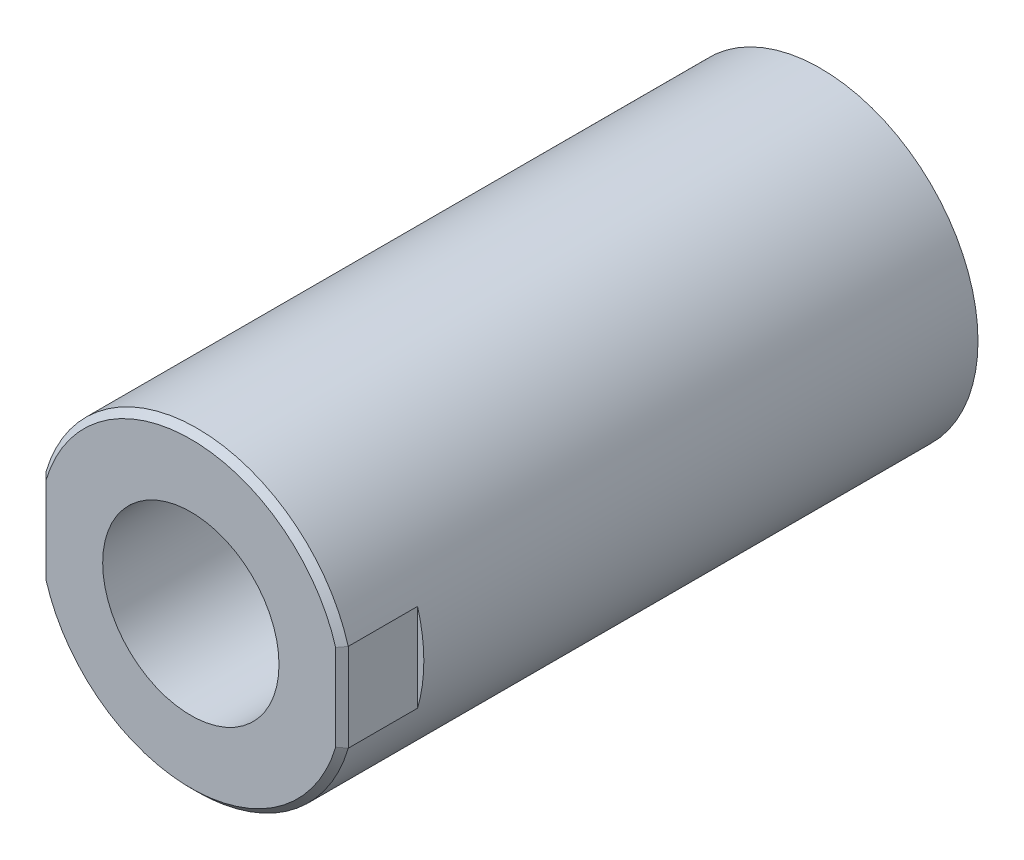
ISO-10303-21;
HEADER;
FILE_DESCRIPTION(('STEP AP214'),'2;1');
FILE_NAME('part.step','',(''),(''),'','','');
FILE_SCHEMA(('AUTOMOTIVE_DESIGN { 1 0 10303 214 1 1 1 1 }'));
ENDSEC;
DATA;
#1=APPLICATION_CONTEXT('core data for automotive mechanical design processes');
#2=APPLICATION_PROTOCOL_DEFINITION('international standard','automotive_design',2000,#1);
#3=PRODUCT_CONTEXT('',#1,'mechanical');
#4=PRODUCT('Part','Part','',(#3));
#5=PRODUCT_RELATED_PRODUCT_CATEGORY('part','',(#4));
#6=PRODUCT_DEFINITION_FORMATION('','',#4);
#7=PRODUCT_DEFINITION_CONTEXT('part definition',#1,'design');
#8=PRODUCT_DEFINITION('design','',#6,#7);
#9=PRODUCT_DEFINITION_SHAPE('','',#8);
#10=(LENGTH_UNIT() NAMED_UNIT(*) SI_UNIT(.MILLI.,.METRE.));
#11=(NAMED_UNIT(*) PLANE_ANGLE_UNIT() SI_UNIT($,.RADIAN.));
#12=(NAMED_UNIT(*) SI_UNIT($,.STERADIAN.) SOLID_ANGLE_UNIT());
#13=UNCERTAINTY_MEASURE_WITH_UNIT(LENGTH_MEASURE(1.E-05),#10,'distance_accuracy_value','');
#14=(GEOMETRIC_REPRESENTATION_CONTEXT(3) GLOBAL_UNCERTAINTY_ASSIGNED_CONTEXT((#13)) GLOBAL_UNIT_ASSIGNED_CONTEXT((#10,
#11,#12)) REPRESENTATION_CONTEXT('',''));
#15=CARTESIAN_POINT('',(0.,0.,0.));
#16=DIRECTION('',(0.,0.,1.));
#17=DIRECTION('',(1.,0.,0.));
#18=AXIS2_PLACEMENT_3D('',#15,#16,#17);
#19=CARTESIAN_POINT('',(0.,0.,-100.));
#20=DIRECTION('',(0.,0.,1.));
#21=DIRECTION('',(1.,0.,0.));
#22=AXIS2_PLACEMENT_3D('',#19,#20,#21);
#23=PLANE('',#22);
#24=CARTESIAN_POINT('',(0.,0.,-100.));
#25=DIRECTION('',(0.,0.,1.));
#26=DIRECTION('',(1.,0.,0.));
#27=AXIS2_PLACEMENT_3D('',#24,#25,#26);
#28=CIRCLE('',#27,25.);
#29=CARTESIAN_POINT('',(25.,0.,-100.));
#30=VERTEX_POINT('',#29);
#31=EDGE_CURVE('E207',#30,#30,#28,.T.);
#32=ORIENTED_EDGE('',*,*,#31,.F.);
#33=EDGE_LOOP('',(#32));
#34=FACE_BOUND('',#33,.T.);
#35=ADVANCED_FACE('F39',(#34),#23,.F.);
#36=CARTESIAN_POINT('',(24.,-10.5,-12.));
#37=DIRECTION('',(0.,0.,-1.));
#38=DIRECTION('',(-1.,0.,0.));
#39=AXIS2_PLACEMENT_3D('',#36,#37,#38);
#40=PLANE('',#39);
#41=CARTESIAN_POINT('',(0.,0.,-12.));
#42=DIRECTION('',(0.,0.,-1.));
#43=DIRECTION('',(-1.,0.,0.));
#44=AXIS2_PLACEMENT_3D('',#41,#42,#43);
#45=CIRCLE('',#44,25.);
#46=CARTESIAN_POINT('',(24.,-7.00000000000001,-12.));
#47=VERTEX_POINT('',#46);
#48=CARTESIAN_POINT('',(24.,7.00000000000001,-12.));
#49=VERTEX_POINT('',#48);
#50=EDGE_CURVE('E210',#47,#49,#45,.F.);
#51=ORIENTED_EDGE('',*,*,#50,.T.);
#52=DIRECTION('',(0.,1.,0.));
#53=VECTOR('',#52,1.);
#54=CARTESIAN_POINT('',(24.,-10.5,-12.));
#55=LINE('',#54,#53);
#56=EDGE_CURVE('E110',#47,#49,#55,.T.);
#57=ORIENTED_EDGE('',*,*,#56,.F.);
#58=EDGE_LOOP('',(#51,#57));
#59=FACE_BOUND('',#58,.T.);
#60=ADVANCED_FACE('F167',(#59),#40,.F.);
#61=CARTESIAN_POINT('',(-26.5,-10.5,-12.));
#62=DIRECTION('',(0.,0.,-1.));
#63=DIRECTION('',(-1.,0.,0.));
#64=AXIS2_PLACEMENT_3D('',#61,#62,#63);
#65=PLANE('',#64);
#66=CARTESIAN_POINT('',(0.,0.,-12.));
#67=DIRECTION('',(0.,0.,-1.));
#68=DIRECTION('',(-1.,0.,0.));
#69=AXIS2_PLACEMENT_3D('',#66,#67,#68);
#70=CIRCLE('',#69,25.);
#71=CARTESIAN_POINT('',(-24.,7.00000000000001,-12.));
#72=VERTEX_POINT('',#71);
#73=CARTESIAN_POINT('',(-24.,-7.00000000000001,-12.));
#74=VERTEX_POINT('',#73);
#75=EDGE_CURVE('E106',#72,#74,#70,.F.);
#76=ORIENTED_EDGE('',*,*,#75,.T.);
#77=DIRECTION('',(0.,1.,0.));
#78=VECTOR('',#77,1.);
#79=CARTESIAN_POINT('',(-24.,-10.5,-12.));
#80=LINE('',#79,#78);
#81=EDGE_CURVE('E101',#74,#72,#80,.T.);
#82=ORIENTED_EDGE('',*,*,#81,.T.);
#83=EDGE_LOOP('',(#76,#82));
#84=FACE_BOUND('',#83,.T.);
#85=ADVANCED_FACE('F109',(#84),#65,.F.);
#86=CARTESIAN_POINT('',(0.,0.,-100.));
#87=DIRECTION('',(0.,0.,1.));
#88=DIRECTION('',(1.,0.,0.));
#89=AXIS2_PLACEMENT_3D('',#86,#87,#88);
#90=CYLINDRICAL_SURFACE('',#89,25.);
#91=DIRECTION('',(0.,0.,1.));
#92=VECTOR('',#91,1.);
#93=CARTESIAN_POINT('',(-24.,7.00000000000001,-100.));
#94=LINE('',#93,#92);
#95=CARTESIAN_POINT('',(-24.,7.00000000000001,-1.));
#96=VERTEX_POINT('',#95);
#97=EDGE_CURVE('E98',#96,#72,#94,.F.);
#98=ORIENTED_EDGE('',*,*,#97,.F.);
#99=CARTESIAN_POINT('',(0.,0.,-1.));
#100=DIRECTION('',(0.,0.,1.));
#101=DIRECTION('',(1.,0.,0.));
#102=AXIS2_PLACEMENT_3D('',#99,#100,#101);
#103=CIRCLE('',#102,25.);
#104=CARTESIAN_POINT('',(24.,7.00000000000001,-1.));
#105=VERTEX_POINT('',#104);
#106=EDGE_CURVE('E52',#96,#105,#103,.F.);
#107=ORIENTED_EDGE('',*,*,#106,.T.);
#108=DIRECTION('',(0.,0.,1.));
#109=VECTOR('',#108,1.);
#110=CARTESIAN_POINT('',(24.,7.00000000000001,-100.));
#111=LINE('',#110,#109);
#112=EDGE_CURVE('E216',#49,#105,#111,.T.);
#113=ORIENTED_EDGE('',*,*,#112,.F.);
#114=ORIENTED_EDGE('',*,*,#50,.F.);
#115=DIRECTION('',(0.,0.,1.));
#116=VECTOR('',#115,1.);
#117=CARTESIAN_POINT('',(24.,-7.00000000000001,-100.));
#118=LINE('',#117,#116);
#119=CARTESIAN_POINT('',(24.,-7.00000000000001,-1.));
#120=VERTEX_POINT('',#119);
#121=EDGE_CURVE('E117',#120,#47,#118,.F.);
#122=ORIENTED_EDGE('',*,*,#121,.F.);
#123=CARTESIAN_POINT('',(0.,0.,-1.));
#124=DIRECTION('',(0.,0.,1.));
#125=DIRECTION('',(1.,0.,0.));
#126=AXIS2_PLACEMENT_3D('',#123,#124,#125);
#127=CIRCLE('',#126,25.);
#128=CARTESIAN_POINT('',(-24.,-7.00000000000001,-1.));
#129=VERTEX_POINT('',#128);
#130=EDGE_CURVE('E60',#120,#129,#127,.F.);
#131=ORIENTED_EDGE('',*,*,#130,.T.);
#132=DIRECTION('',(0.,0.,1.));
#133=VECTOR('',#132,1.);
#134=CARTESIAN_POINT('',(-24.,-7.00000000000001,-100.));
#135=LINE('',#134,#133);
#136=EDGE_CURVE('E115',#74,#129,#135,.T.);
#137=ORIENTED_EDGE('',*,*,#136,.F.);
#138=ORIENTED_EDGE('',*,*,#75,.F.);
#139=EDGE_LOOP('',(#98,#107,#113,#114,#122,#131,#137,#138));
#140=FACE_BOUND('',#139,.T.);
#141=ORIENTED_EDGE('',*,*,#31,.T.);
#142=EDGE_LOOP('',(#141));
#143=FACE_BOUND('',#142,.T.);
#144=ADVANCED_FACE('F113',(#140,#143),#90,.T.);
#145=CARTESIAN_POINT('',(24.,-10.5,0.));
#146=DIRECTION('',(-1.,0.,0.));
#147=DIRECTION('',(0.,0.,1.));
#148=AXIS2_PLACEMENT_3D('',#145,#146,#147);
#149=PLANE('',#148);
#150=ORIENTED_EDGE('',*,*,#112,.T.);
#151=DIRECTION('',(0.,-1.,0.));
#152=VECTOR('',#151,1.);
#153=CARTESIAN_POINT('',(24.,-7.00000000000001,-1.00000000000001));
#154=LINE('',#153,#152);
#155=EDGE_CURVE('E129',#105,#120,#154,.T.);
#156=ORIENTED_EDGE('',*,*,#155,.T.);
#157=ORIENTED_EDGE('',*,*,#121,.T.);
#158=ORIENTED_EDGE('',*,*,#56,.T.);
#159=EDGE_LOOP('',(#150,#156,#157,#158));
#160=FACE_BOUND('',#159,.T.);
#161=ADVANCED_FACE('F180',(#160),#149,.F.);
#162=CARTESIAN_POINT('',(-24.,-10.5,0.));
#163=DIRECTION('',(1.,0.,0.));
#164=DIRECTION('',(0.,0.,-1.));
#165=AXIS2_PLACEMENT_3D('',#162,#163,#164);
#166=PLANE('',#165);
#167=ORIENTED_EDGE('',*,*,#136,.T.);
#168=DIRECTION('',(0.,1.,0.));
#169=VECTOR('',#168,1.);
#170=CARTESIAN_POINT('',(-24.,7.00000000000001,-1.00000000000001));
#171=LINE('',#170,#169);
#172=EDGE_CURVE('E11',#129,#96,#171,.T.);
#173=ORIENTED_EDGE('',*,*,#172,.T.);
#174=ORIENTED_EDGE('',*,*,#97,.T.);
#175=ORIENTED_EDGE('',*,*,#81,.F.);
#176=EDGE_LOOP('',(#167,#173,#174,#175));
#177=FACE_BOUND('',#176,.T.);
#178=ADVANCED_FACE('F100',(#177),#166,.F.);
#179=CARTESIAN_POINT('',(0.,0.,0.));
#180=DIRECTION('',(0.,0.,1.));
#181=DIRECTION('',(1.,0.,0.));
#182=AXIS2_PLACEMENT_3D('',#179,#180,#181);
#183=PLANE('',#182);
#184=CARTESIAN_POINT('',(0.,0.,0.));
#185=DIRECTION('',(0.,0.,1.));
#186=DIRECTION('',(1.,0.,0.));
#187=AXIS2_PLACEMENT_3D('',#184,#185,#186);
#188=CIRCLE('',#187,24.);
#189=CARTESIAN_POINT('',(-23.,-6.85565460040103,0.));
#190=VERTEX_POINT('',#189);
#191=CARTESIAN_POINT('',(23.,-6.85565460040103,0.));
#192=VERTEX_POINT('',#191);
#193=EDGE_CURVE('E105',#190,#192,#188,.T.);
#194=ORIENTED_EDGE('',*,*,#193,.T.);
#195=DIRECTION('',(0.,1.,0.));
#196=VECTOR('',#195,1.);
#197=CARTESIAN_POINT('',(23.,7.00000000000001,0.));
#198=LINE('',#197,#196);
#199=CARTESIAN_POINT('',(23.,6.85565460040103,0.));
#200=VERTEX_POINT('',#199);
#201=EDGE_CURVE('E126',#192,#200,#198,.T.);
#202=ORIENTED_EDGE('',*,*,#201,.T.);
#203=CARTESIAN_POINT('',(0.,0.,0.));
#204=DIRECTION('',(0.,0.,1.));
#205=DIRECTION('',(1.,0.,0.));
#206=AXIS2_PLACEMENT_3D('',#203,#204,#205);
#207=CIRCLE('',#206,24.);
#208=CARTESIAN_POINT('',(-23.,6.85565460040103,0.));
#209=VERTEX_POINT('',#208);
#210=EDGE_CURVE('E124',#200,#209,#207,.T.);
#211=ORIENTED_EDGE('',*,*,#210,.T.);
#212=DIRECTION('',(0.,-1.,0.));
#213=VECTOR('',#212,1.);
#214=CARTESIAN_POINT('',(-23.,-7.00000000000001,0.));
#215=LINE('',#214,#213);
#216=EDGE_CURVE('E122',#209,#190,#215,.T.);
#217=ORIENTED_EDGE('',*,*,#216,.T.);
#218=EDGE_LOOP('',(#194,#202,#211,#217));
#219=FACE_BOUND('',#218,.T.);
#220=CARTESIAN_POINT('',(0.,0.,0.));
#221=DIRECTION('',(0.,0.,-1.));
#222=DIRECTION('',(-1.,0.,0.));
#223=AXIS2_PLACEMENT_3D('',#220,#221,#222);
#224=CIRCLE('',#223,14.);
#225=CARTESIAN_POINT('',(-14.,0.,0.));
#226=VERTEX_POINT('',#225);
#227=EDGE_CURVE('E111',#226,#226,#224,.F.);
#228=ORIENTED_EDGE('',*,*,#227,.F.);
#229=EDGE_LOOP('',(#228));
#230=FACE_BOUND('',#229,.T.);
#231=ADVANCED_FACE('F192',(#219,#230),#183,.T.);
#232=CARTESIAN_POINT('',(0.,0.,15.));
#233=DIRECTION('',(0.,0.,1.));
#234=DIRECTION('',(1.,0.,0.));
#235=AXIS2_PLACEMENT_3D('',#232,#233,#234);
#236=CYLINDRICAL_SURFACE('',#235,14.);
#237=ORIENTED_EDGE('',*,*,#227,.T.);
#238=EDGE_LOOP('',(#237));
#239=FACE_BOUND('',#238,.T.);
#240=CARTESIAN_POINT('',(0.,0.,-51.));
#241=DIRECTION('',(0.,0.,1.));
#242=DIRECTION('',(1.,0.,0.));
#243=AXIS2_PLACEMENT_3D('',#240,#241,#242);
#244=CIRCLE('',#243,14.);
#245=CARTESIAN_POINT('',(14.,0.,-51.));
#246=VERTEX_POINT('',#245);
#247=EDGE_CURVE('E205',#246,#246,#244,.T.);
#248=ORIENTED_EDGE('',*,*,#247,.F.);
#249=EDGE_LOOP('',(#248));
#250=FACE_BOUND('',#249,.T.);
#251=ADVANCED_FACE('F177',(#239,#250),#236,.F.);
#252=CARTESIAN_POINT('',(0.,0.,-51.));
#253=DIRECTION('',(0.,0.,1.));
#254=DIRECTION('',(1.,0.,0.));
#255=AXIS2_PLACEMENT_3D('',#252,#253,#254);
#256=CONICAL_SURFACE('',#255,14.,1.02974425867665);
#257=CARTESIAN_POINT('',(0.,0.,-59.4120486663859));
#258=VERTEX_POINT('',#257);
#259=VERTEX_LOOP('',#258);
#260=FACE_BOUND('',#259,.T.);
#261=ORIENTED_EDGE('',*,*,#247,.T.);
#262=EDGE_LOOP('',(#261));
#263=FACE_BOUND('',#262,.T.);
#264=ADVANCED_FACE('F163',(#260,#263),#256,.F.);
#265=CARTESIAN_POINT('',(-24.,-10.5,-1.00000000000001));
#266=DIRECTION('',(-0.707106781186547,0.,0.707106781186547));
#267=DIRECTION('',(0.707106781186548,0.,0.707106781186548));
#268=AXIS2_PLACEMENT_3D('',#265,#266,#267);
#269=PLANE('',#268);
#270=CARTESIAN_POINT('',(-23.,6.85565460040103,0.));
#271=CARTESIAN_POINT('',(-23.1666487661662,6.87996020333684,-0.166648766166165));
#272=CARTESIAN_POINT('',(-23.3333064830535,6.90414178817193,-0.333306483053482));
#273=CARTESIAN_POINT('',(-23.666639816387,6.95225692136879,-0.666639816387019));
#274=CARTESIAN_POINT('',(-23.833315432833,6.97619046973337,-0.833315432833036));
#275=CARTESIAN_POINT('',(-24.,7.00000000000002,-1.));
#276=B_SPLINE_CURVE_WITH_KNOTS('',3,(#270,#271,#272,#273,#274,#275),.UNSPECIFIED.,.F.,.F.,(4,2,
4),(0.,0.710780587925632,1.42156116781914),.UNSPECIFIED.);
#277=EDGE_CURVE('E228',#96,#209,#276,.F.);
#278=ORIENTED_EDGE('',*,*,#277,.F.);
#279=ORIENTED_EDGE('',*,*,#172,.F.);
#280=CARTESIAN_POINT('',(-23.,-6.85565460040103,0.));
#281=CARTESIAN_POINT('',(-23.1666487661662,-6.87996020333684,-0.166648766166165));
#282=CARTESIAN_POINT('',(-23.3333064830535,-6.90414178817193,-0.333306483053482));
#283=CARTESIAN_POINT('',(-23.666639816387,-6.95225692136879,-0.666639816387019));
#284=CARTESIAN_POINT('',(-23.833315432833,-6.97619046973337,-0.833315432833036));
#285=CARTESIAN_POINT('',(-24.,-7.00000000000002,-1.));
#286=B_SPLINE_CURVE_WITH_KNOTS('',3,(#280,#281,#282,#283,#284,#285),.UNSPECIFIED.,.F.,.F.,(4,2,
4),(0.,0.710780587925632,1.42156116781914),.UNSPECIFIED.);
#287=EDGE_CURVE('E44',#190,#129,#286,.T.);
#288=ORIENTED_EDGE('',*,*,#287,.F.);
#289=ORIENTED_EDGE('',*,*,#216,.F.);
#290=EDGE_LOOP('',(#278,#279,#288,#289));
#291=FACE_BOUND('',#290,.T.);
#292=ADVANCED_FACE('F41',(#291),#269,.T.);
#293=CARTESIAN_POINT('',(0.,0.,0.));
#294=DIRECTION('',(0.,0.,-1.));
#295=DIRECTION('',(-1.,0.,0.));
#296=AXIS2_PLACEMENT_3D('',#293,#294,#295);
#297=CONICAL_SURFACE('',#296,24.,0.785398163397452);
#298=ORIENTED_EDGE('',*,*,#287,.T.);
#299=ORIENTED_EDGE('',*,*,#130,.F.);
#300=CARTESIAN_POINT('',(24.,-7.00000000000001,-1.));
#301=CARTESIAN_POINT('',(23.833315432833,-6.97619046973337,-0.833315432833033));
#302=CARTESIAN_POINT('',(23.666639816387,-6.9522569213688,-0.666639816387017));
#303=CARTESIAN_POINT('',(23.3333064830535,-6.90414178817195,-0.33330648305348));
#304=CARTESIAN_POINT('',(23.1666487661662,-6.87996020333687,-0.166648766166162));
#305=CARTESIAN_POINT('',(23.,-6.85565460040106,0.));
#306=B_SPLINE_CURVE_WITH_KNOTS('',3,(#300,#301,#302,#303,#304,#305),.UNSPECIFIED.,.F.,.F.,(4,2,
4),(0.,0.710780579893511,1.42156116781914),.UNSPECIFIED.);
#307=EDGE_CURVE('E141',#192,#120,#306,.F.);
#308=ORIENTED_EDGE('',*,*,#307,.F.);
#309=ORIENTED_EDGE('',*,*,#193,.F.);
#310=EDGE_LOOP('',(#298,#299,#308,#309));
#311=FACE_BOUND('',#310,.T.);
#312=ADVANCED_FACE('F152',(#311),#297,.T.);
#313=CARTESIAN_POINT('',(0.,0.,0.));
#314=DIRECTION('',(0.,0.,-1.));
#315=DIRECTION('',(-1.,0.,0.));
#316=AXIS2_PLACEMENT_3D('',#313,#314,#315);
#317=CONICAL_SURFACE('',#316,24.,0.785398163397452);
#318=ORIENTED_EDGE('',*,*,#277,.T.);
#319=ORIENTED_EDGE('',*,*,#210,.F.);
#320=CARTESIAN_POINT('',(23.,6.85565460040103,0.));
#321=CARTESIAN_POINT('',(23.1666487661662,6.87996020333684,-0.166648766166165));
#322=CARTESIAN_POINT('',(23.3333064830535,6.90414178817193,-0.333306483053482));
#323=CARTESIAN_POINT('',(23.666639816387,6.95225692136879,-0.666639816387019));
#324=CARTESIAN_POINT('',(23.833315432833,6.97619046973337,-0.833315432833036));
#325=CARTESIAN_POINT('',(24.,7.00000000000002,-1.));
#326=B_SPLINE_CURVE_WITH_KNOTS('',3,(#320,#321,#322,#323,#324,#325),.UNSPECIFIED.,.F.,.F.,(4,2,
4),(0.,0.710780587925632,1.42156116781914),.UNSPECIFIED.);
#327=EDGE_CURVE('E134',#105,#200,#326,.F.);
#328=ORIENTED_EDGE('',*,*,#327,.F.);
#329=ORIENTED_EDGE('',*,*,#106,.F.);
#330=EDGE_LOOP('',(#318,#319,#328,#329));
#331=FACE_BOUND('',#330,.T.);
#332=ADVANCED_FACE('F145',(#331),#317,.T.);
#333=CARTESIAN_POINT('',(23.,0.,0.));
#334=DIRECTION('',(0.707106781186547,0.,0.707106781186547));
#335=DIRECTION('',(0.707106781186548,0.,-0.707106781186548));
#336=AXIS2_PLACEMENT_3D('',#333,#334,#335);
#337=PLANE('',#336);
#338=ORIENTED_EDGE('',*,*,#307,.T.);
#339=ORIENTED_EDGE('',*,*,#155,.F.);
#340=ORIENTED_EDGE('',*,*,#327,.T.);
#341=ORIENTED_EDGE('',*,*,#201,.F.);
#342=EDGE_LOOP('',(#338,#339,#340,#341));
#343=FACE_BOUND('',#342,.T.);
#344=ADVANCED_FACE('F148',(#343),#337,.T.);
#345=CLOSED_SHELL('',(#35,#60,#85,#144,#161,#178,#231,#251,#264,#292,#312,#332,#344));
#346=MANIFOLD_SOLID_BREP('B2',#345);
#347=ADVANCED_BREP_SHAPE_REPRESENTATION('',(#18,#346),#14);
#348=SHAPE_DEFINITION_REPRESENTATION(#9,#347);
ENDSEC;
END-ISO-10303-21;
